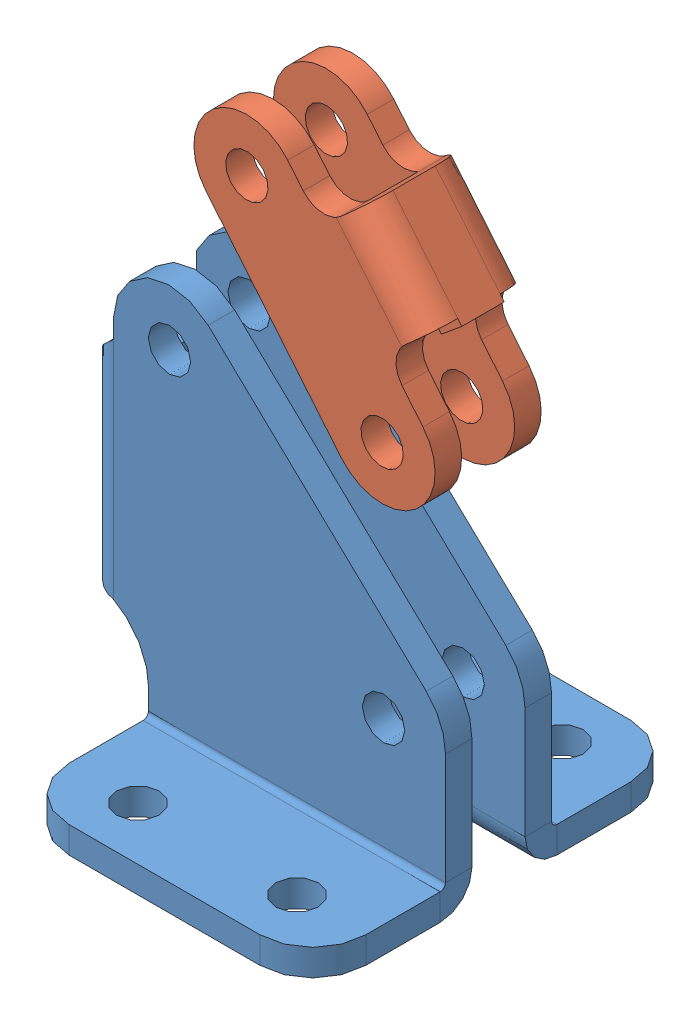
SolidWorks assembly collision_&.sldasm, configuration Default (file format 15000). Lengths in mm.
Overall size (117.02 139.51 44.45).
11 component instances, 7 part files, 10 mates.
Components (placement in the parent):
- base_&-2: base_&.SLDPRT [Default] at origin size (42.93 49.25 44.45)
- link_&-2: link_&.SLDPRT [Default] at (19.1438 65.2338 0) x (0.637827 -0.770179 0) z (0 0 1) size (38.1 19.05 12.7)
- hold-down sub-assy_&-1: hold-down sub-assy_&.SLDASM [Default] at (4.7398 32.3172 -6.35) x (0.992547 0.12186 0) z (0 0 1) size (96.01 63.5 19.3)
  - arm_&-1: arm_&.SLDPRT [Default] at origin size (96.01 23.62 15.88)
  - washer_&-1: washer_&.SLDPRT [Default] at (73.787 -2.286 0) x (0 0 -1) z (1 0 0) size (18.8 3.81 22.23)
  - washer_&-2: washer_&.SLDPRT [Default] at (73.787 18.161 0) x (0 0 -1) z (-1 0 0) size (18.8 3.81 22.23)
  - hold-down bolt_&-1: hold-down bolt_&.sldprt [Default] at (73.787 -32.766 0) size (19.3 63.5 19.3)
- handle sub-assy_&-1: handle sub-assy_&.sldasm [Default] at (9.0966 3.9197 -12.7) x (0.322325 -0.946629 0) z (0 0 1) size (132.59 16.51 25.4)
  - handle-half_&-1: handle-half_&.SLDPRT [Default] at (2.3468 22.924 12.7) size (130.68 12.7 12.7)
  - handle-half_&-2: handle-half_&.SLDPRT [Default] at (2.3468 35.624 0) x (1 0 0) z (0 0 -1) size (130.68 12.7 12.7)
  - sleeve_&-1: sleeve_&.sldprt [Default] at (-128.3362 22.924 3.175) size (52.77 16.51 10.16)
Mates (geometry in assembly coordinates):
- MateCoincident15: coincident aligned: plane of base_&-2 through (0 50.8 0) normal (0 0 1); plane of assembly through (0 0 0) normal (0 0 1)
- MateCoincident16: coincident anti-aligned: plane of base_&-2 through (0 0 -12.7) normal (0 -1 0); plane of assembly through (0 0 0) normal (0 1 0)
- MateCoincident17: coincident anti-aligned: plane of base_&-2 through (0 50.8 -12.7) normal (-1 0 0); plane of assembly through (0 0 0) normal (1 0 0)
- MateConcentric10: concentric aligned: cylinder of base_&-2 through (35.5179 17.145 -28.575) axis (0 0 1) radius 2.54; cylinder of handle sub-assy_&-1/handle-half_&-1 through (35.5179 17.145 -6.35) axis (0 0 1) radius 2.54
- MateCoincident20: coincident anti-aligned: plane of base_&-2 through (0 50.8 0) normal (0 0 1); plane of handle sub-assy_&-1/handle-half_&-1 through (43.5758 13.1807 0) normal (0 0 -1)
- MateConcentric11: concentric aligned: cylinder of handle sub-assy_&-1/handle-half_&-1 through (19.1438 65.2338 -6.35) axis (0 0 1) radius 2.54; cylinder of link_&-2 through (19.1438 65.2338 -12.7) axis (0 0 1) radius 2.54
- MateCoincident21: coincident anti-aligned: plane of handle sub-assy_&-1/handle-half_&-1 through (27.0379 61.7503 0) normal (0 0 -1); plane of link_&-2 through (10.2029 66.0742 0) normal (0 0 1)
- Concentric1: concentric aligned: cylinder of base_&-2 through (9.8818 42.545 -28.575) axis (0 0 1) radius 2.54; cylinder of hold-down sub-assy_&-1/arm_&-1 through (9.8818 42.545 -14.2875) axis (0 0 1) radius 2.54
- Coincident1: coincident anti-aligned: plane of base_&-2 through (42.926 50.8 -3.175) normal (0 0 -1); plane of hold-down sub-assy_&-1/arm_&-1 through (2.6375 32.0591 -3.175) normal (0 0 1)
- Concentric2: concentric aligned: cylinder of hold-down sub-assy_&-1/arm_&-1 through (35.3446 45.6712 -14.2875) axis (0 0 1) radius 2.54; cylinder of link_&-2 through (35.3446 45.6712 -12.7) axis (0 0 1) radius 2.54
